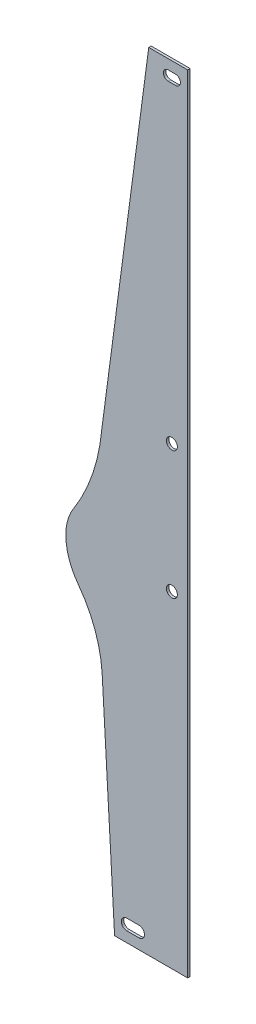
ISO-10303-21;
HEADER;
FILE_DESCRIPTION(('STEP AP214'),'2;1');
FILE_NAME('part.step','',(''),(''),'','','');
FILE_SCHEMA(('AUTOMOTIVE_DESIGN { 1 0 10303 214 1 1 1 1 }'));
ENDSEC;
DATA;
#1=APPLICATION_CONTEXT('core data for automotive mechanical design processes');
#2=APPLICATION_PROTOCOL_DEFINITION('international standard','automotive_design',2000,#1);
#3=PRODUCT_CONTEXT('',#1,'mechanical');
#4=PRODUCT('Part','Part','',(#3));
#5=PRODUCT_RELATED_PRODUCT_CATEGORY('part','',(#4));
#6=PRODUCT_DEFINITION_FORMATION('','',#4);
#7=PRODUCT_DEFINITION_CONTEXT('part definition',#1,'design');
#8=PRODUCT_DEFINITION('design','',#6,#7);
#9=PRODUCT_DEFINITION_SHAPE('','',#8);
#10=(LENGTH_UNIT() NAMED_UNIT(*) SI_UNIT(.MILLI.,.METRE.));
#11=(NAMED_UNIT(*) PLANE_ANGLE_UNIT() SI_UNIT($,.RADIAN.));
#12=(NAMED_UNIT(*) SI_UNIT($,.STERADIAN.) SOLID_ANGLE_UNIT());
#13=UNCERTAINTY_MEASURE_WITH_UNIT(LENGTH_MEASURE(1.E-05),#10,'distance_accuracy_value','');
#14=(GEOMETRIC_REPRESENTATION_CONTEXT(3) GLOBAL_UNCERTAINTY_ASSIGNED_CONTEXT((#13)) GLOBAL_UNIT_ASSIGNED_CONTEXT((#10,
#11,#12)) REPRESENTATION_CONTEXT('',''));
#15=CARTESIAN_POINT('',(0.,0.,0.));
#16=DIRECTION('',(0.,0.,1.));
#17=DIRECTION('',(1.,0.,0.));
#18=AXIS2_PLACEMENT_3D('',#15,#16,#17);
#19=CARTESIAN_POINT('',(-175.961770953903,-39.5408678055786,2.));
#20=DIRECTION('',(0.,0.,1.));
#21=DIRECTION('',(1.,0.,0.));
#22=AXIS2_PLACEMENT_3D('',#19,#20,#21);
#23=PLANE('',#22);
#24=DIRECTION('',(-1.,0.,0.));
#25=VECTOR('',#24,1.);
#26=CARTESIAN_POINT('',(4.03822904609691,-389.510375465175,2.));
#27=LINE('',#26,#25);
#28=CARTESIAN_POINT('',(4.03822904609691,-389.510375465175,2.));
#29=VERTEX_POINT('',#28);
#30=CARTESIAN_POINT('',(-5.96177095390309,-389.510375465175,2.));
#31=VERTEX_POINT('',#30);
#32=EDGE_CURVE('E199',#29,#31,#27,.T.);
#33=ORIENTED_EDGE('',*,*,#32,.F.);
#34=CARTESIAN_POINT('',(4.03822904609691,-394.010375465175,2.));
#35=DIRECTION('',(0.,0.,1.));
#36=DIRECTION('',(1.,0.,0.));
#37=AXIS2_PLACEMENT_3D('',#34,#35,#36);
#38=CIRCLE('',#37,4.5);
#39=CARTESIAN_POINT('',(4.03822904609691,-398.510375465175,2.));
#40=VERTEX_POINT('',#39);
#41=EDGE_CURVE('E197',#40,#29,#38,.T.);
#42=ORIENTED_EDGE('',*,*,#41,.F.);
#43=DIRECTION('',(1.,0.,0.));
#44=VECTOR('',#43,1.);
#45=CARTESIAN_POINT('',(4.03822904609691,-398.510375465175,2.));
#46=LINE('',#45,#44);
#47=CARTESIAN_POINT('',(-5.96177095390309,-398.510375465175,2.));
#48=VERTEX_POINT('',#47);
#49=EDGE_CURVE('E204',#48,#40,#46,.T.);
#50=ORIENTED_EDGE('',*,*,#49,.F.);
#51=CARTESIAN_POINT('',(-5.96177095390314,-394.010375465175,2.));
#52=DIRECTION('',(0.,0.,1.));
#53=DIRECTION('',(1.,0.,0.));
#54=AXIS2_PLACEMENT_3D('',#51,#52,#53);
#55=CIRCLE('',#54,4.5);
#56=EDGE_CURVE('E202',#31,#48,#55,.T.);
#57=ORIENTED_EDGE('',*,*,#56,.F.);
#58=EDGE_LOOP('',(#33,#42,#50,#57));
#59=FACE_BOUND('',#58,.T.);
#60=CARTESIAN_POINT('',(31.0382290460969,-34.0103754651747,2.));
#61=DIRECTION('',(0.,0.,1.));
#62=DIRECTION('',(1.,0.,0.));
#63=AXIS2_PLACEMENT_3D('',#60,#61,#62);
#64=CIRCLE('',#63,4.50000000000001);
#65=CARTESIAN_POINT('',(35.5382290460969,-34.0103754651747,2.));
#66=VERTEX_POINT('',#65);
#67=EDGE_CURVE('E225',#66,#66,#64,.T.);
#68=ORIENTED_EDGE('',*,*,#67,.F.);
#69=EDGE_LOOP('',(#68));
#70=FACE_BOUND('',#69,.T.);
#71=DIRECTION('',(-1.,0.,0.));
#72=VECTOR('',#71,1.);
#73=CARTESIAN_POINT('',(44.0382290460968,237.989624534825,2.));
#74=LINE('',#73,#72);
#75=CARTESIAN_POINT('',(44.0382290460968,237.989624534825,2.));
#76=VERTEX_POINT('',#75);
#77=CARTESIAN_POINT('',(12.0382290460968,237.989624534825,2.));
#78=VERTEX_POINT('',#77);
#79=EDGE_CURVE('E247',#76,#78,#74,.T.);
#80=ORIENTED_EDGE('',*,*,#79,.T.);
#81=DIRECTION('',(-0.131345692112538,-0.991336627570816,0.));
#82=VECTOR('',#81,1.);
#83=CARTESIAN_POINT('',(-27.9896974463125,-64.1226794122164,2.));
#84=LINE('',#83,#82);
#85=CARTESIAN_POINT('',(-27.9896974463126,-64.1226794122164,2.));
#86=VERTEX_POINT('',#85);
#87=EDGE_CURVE('E250',#78,#86,#84,.T.);
#88=ORIENTED_EDGE('',*,*,#87,.T.);
#89=CARTESIAN_POINT('',(-175.961770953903,-39.5408678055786,2.));
#90=DIRECTION('',(0.,0.,-1.));
#91=DIRECTION('',(1.,0.,0.));
#92=AXIS2_PLACEMENT_3D('',#89,#90,#91);
#93=CIRCLE('',#92,150.);
#94=CARTESIAN_POINT('',(-49.6459814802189,-120.437847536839,2.));
#95=VERTEX_POINT('',#94);
#96=EDGE_CURVE('E252',#86,#95,#93,.T.);
#97=ORIENTED_EDGE('',*,*,#96,.T.);
#98=CARTESIAN_POINT('',(-15.9617709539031,-142.010375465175,2.));
#99=DIRECTION('',(0.,0.,1.));
#100=DIRECTION('',(1.,0.,0.));
#101=AXIS2_PLACEMENT_3D('',#98,#99,#100);
#102=CIRCLE('',#101,40.);
#103=CARTESIAN_POINT('',(-55.9617709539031,-142.010375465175,2.));
#104=VERTEX_POINT('',#103);
#105=EDGE_CURVE('E254',#95,#104,#102,.T.);
#106=ORIENTED_EDGE('',*,*,#105,.T.);
#107=CARTESIAN_POINT('',(-5.96177095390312,-142.010375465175,2.));
#108=DIRECTION('',(0.,0.,1.));
#109=DIRECTION('',(1.,0.,0.));
#110=AXIS2_PLACEMENT_3D('',#107,#108,#109);
#111=CIRCLE('',#110,50.);
#112=CARTESIAN_POINT('',(-45.9617709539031,-172.010375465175,2.));
#113=VERTEX_POINT('',#112);
#114=EDGE_CURVE('E256',#104,#113,#111,.T.);
#115=ORIENTED_EDGE('',*,*,#114,.T.);
#116=CARTESIAN_POINT('',(-125.961770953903,-232.010375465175,2.));
#117=DIRECTION('',(0.,0.,-1.));
#118=DIRECTION('',(1.,0.,0.));
#119=AXIS2_PLACEMENT_3D('',#116,#117,#118);
#120=CIRCLE('',#119,100.);
#121=CARTESIAN_POINT('',(-26.1195429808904,-226.395260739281,2.));
#122=VERTEX_POINT('',#121);
#123=EDGE_CURVE('E258',#113,#122,#120,.T.);
#124=ORIENTED_EDGE('',*,*,#123,.T.);
#125=DIRECTION('',(0.0561511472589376,-0.998422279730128,0.));
#126=VECTOR('',#125,1.);
#127=CARTESIAN_POINT('',(-26.1195429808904,-226.395260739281,2.));
#128=LINE('',#127,#126);
#129=CARTESIAN_POINT('',(-15.9617709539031,-407.010375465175,2.));
#130=VERTEX_POINT('',#129);
#131=EDGE_CURVE('E260',#122,#130,#128,.T.);
#132=ORIENTED_EDGE('',*,*,#131,.T.);
#133=DIRECTION('',(1.,0.,0.));
#134=VECTOR('',#133,1.);
#135=CARTESIAN_POINT('',(44.0382290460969,-407.010375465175,2.));
#136=LINE('',#135,#134);
#137=CARTESIAN_POINT('',(44.0382290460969,-407.010375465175,2.));
#138=VERTEX_POINT('',#137);
#139=EDGE_CURVE('E262',#130,#138,#136,.T.);
#140=ORIENTED_EDGE('',*,*,#139,.T.);
#141=DIRECTION('',(0.,1.,0.));
#142=VECTOR('',#141,1.);
#143=CARTESIAN_POINT('',(44.0382290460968,237.989624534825,2.));
#144=LINE('',#143,#142);
#145=EDGE_CURVE('E264',#138,#76,#144,.T.);
#146=ORIENTED_EDGE('',*,*,#145,.T.);
#147=EDGE_LOOP('',(#80,#88,#97,#106,#115,#124,#132,#140,#146));
#148=FACE_BOUND('',#147,.T.);
#149=CARTESIAN_POINT('',(31.0382290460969,-139.010375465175,2.));
#150=DIRECTION('',(0.,0.,1.));
#151=DIRECTION('',(1.,0.,0.));
#152=AXIS2_PLACEMENT_3D('',#149,#150,#151);
#153=CIRCLE('',#152,4.50000000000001);
#154=CARTESIAN_POINT('',(35.5382290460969,-139.010375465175,2.));
#155=VERTEX_POINT('',#154);
#156=EDGE_CURVE('E219',#155,#155,#153,.T.);
#157=ORIENTED_EDGE('',*,*,#156,.F.);
#158=EDGE_LOOP('',(#157));
#159=FACE_BOUND('',#158,.T.);
#160=DIRECTION('',(-1.,0.,0.));
#161=VECTOR('',#160,1.);
#162=CARTESIAN_POINT('',(34.0382290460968,229.989624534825,2.));
#163=LINE('',#162,#161);
#164=CARTESIAN_POINT('',(34.0382290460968,229.989624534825,2.));
#165=VERTEX_POINT('',#164);
#166=CARTESIAN_POINT('',(28.0382290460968,229.989624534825,2.));
#167=VERTEX_POINT('',#166);
#168=EDGE_CURVE('E175',#165,#167,#163,.T.);
#169=ORIENTED_EDGE('',*,*,#168,.F.);
#170=CARTESIAN_POINT('',(34.0382290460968,225.989624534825,2.));
#171=DIRECTION('',(0.,0.,1.));
#172=DIRECTION('',(1.,0.,0.));
#173=AXIS2_PLACEMENT_3D('',#170,#171,#172);
#174=CIRCLE('',#173,4.);
#175=CARTESIAN_POINT('',(34.0382290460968,221.989624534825,2.));
#176=VERTEX_POINT('',#175);
#177=EDGE_CURVE('E166',#176,#165,#174,.T.);
#178=ORIENTED_EDGE('',*,*,#177,.F.);
#179=DIRECTION('',(1.,0.,0.));
#180=VECTOR('',#179,1.);
#181=CARTESIAN_POINT('',(34.0382290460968,221.989624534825,2.));
#182=LINE('',#181,#180);
#183=CARTESIAN_POINT('',(28.0382290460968,221.989624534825,2.));
#184=VERTEX_POINT('',#183);
#185=EDGE_CURVE('E179',#184,#176,#182,.T.);
#186=ORIENTED_EDGE('',*,*,#185,.F.);
#187=CARTESIAN_POINT('',(28.0382290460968,225.989624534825,2.));
#188=DIRECTION('',(0.,0.,1.));
#189=DIRECTION('',(1.,0.,0.));
#190=AXIS2_PLACEMENT_3D('',#187,#188,#189);
#191=CIRCLE('',#190,4.);
#192=EDGE_CURVE('E177',#167,#184,#191,.T.);
#193=ORIENTED_EDGE('',*,*,#192,.F.);
#194=EDGE_LOOP('',(#169,#178,#186,#193));
#195=FACE_BOUND('',#194,.T.);
#196=ADVANCED_FACE('F30',(#59,#70,#148,#159,#195),#23,.T.);
#197=CARTESIAN_POINT('',(-175.961770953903,-39.5408678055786,0.));
#198=DIRECTION('',(0.,0.,1.));
#199=DIRECTION('',(1.,0.,0.));
#200=AXIS2_PLACEMENT_3D('',#197,#198,#199);
#201=PLANE('',#200);
#202=DIRECTION('',(-1.,0.,0.));
#203=VECTOR('',#202,1.);
#204=CARTESIAN_POINT('',(4.03822904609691,-389.510375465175,0.));
#205=LINE('',#204,#203);
#206=CARTESIAN_POINT('',(4.03822904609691,-389.510375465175,0.));
#207=VERTEX_POINT('',#206);
#208=CARTESIAN_POINT('',(-5.96177095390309,-389.510375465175,0.));
#209=VERTEX_POINT('',#208);
#210=EDGE_CURVE('E188',#207,#209,#205,.T.);
#211=ORIENTED_EDGE('',*,*,#210,.T.);
#212=CARTESIAN_POINT('',(-5.96177095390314,-394.010375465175,0.));
#213=DIRECTION('',(0.,0.,1.));
#214=DIRECTION('',(1.,0.,0.));
#215=AXIS2_PLACEMENT_3D('',#212,#213,#214);
#216=CIRCLE('',#215,4.5);
#217=CARTESIAN_POINT('',(-5.96177095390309,-398.510375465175,0.));
#218=VERTEX_POINT('',#217);
#219=EDGE_CURVE('E191',#209,#218,#216,.T.);
#220=ORIENTED_EDGE('',*,*,#219,.T.);
#221=DIRECTION('',(1.,0.,0.));
#222=VECTOR('',#221,1.);
#223=CARTESIAN_POINT('',(4.03822904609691,-398.510375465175,0.));
#224=LINE('',#223,#222);
#225=CARTESIAN_POINT('',(4.03822904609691,-398.510375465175,0.));
#226=VERTEX_POINT('',#225);
#227=EDGE_CURVE('E194',#218,#226,#224,.T.);
#228=ORIENTED_EDGE('',*,*,#227,.T.);
#229=CARTESIAN_POINT('',(4.03822904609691,-394.010375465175,0.));
#230=DIRECTION('',(0.,0.,1.));
#231=DIRECTION('',(1.,0.,0.));
#232=AXIS2_PLACEMENT_3D('',#229,#230,#231);
#233=CIRCLE('',#232,4.5);
#234=EDGE_CURVE('E167',#226,#207,#233,.T.);
#235=ORIENTED_EDGE('',*,*,#234,.T.);
#236=EDGE_LOOP('',(#211,#220,#228,#235));
#237=FACE_BOUND('',#236,.T.);
#238=CARTESIAN_POINT('',(31.0382290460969,-34.0103754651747,0.));
#239=DIRECTION('',(0.,0.,1.));
#240=DIRECTION('',(1.,0.,0.));
#241=AXIS2_PLACEMENT_3D('',#238,#239,#240);
#242=CIRCLE('',#241,4.50000000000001);
#243=CARTESIAN_POINT('',(35.5382290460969,-34.0103754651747,0.));
#244=VERTEX_POINT('',#243);
#245=EDGE_CURVE('E222',#244,#244,#242,.T.);
#246=ORIENTED_EDGE('',*,*,#245,.T.);
#247=EDGE_LOOP('',(#246));
#248=FACE_BOUND('',#247,.T.);
#249=DIRECTION('',(-1.,0.,0.));
#250=VECTOR('',#249,1.);
#251=CARTESIAN_POINT('',(44.0382290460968,237.989624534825,0.));
#252=LINE('',#251,#250);
#253=CARTESIAN_POINT('',(44.0382290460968,237.989624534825,0.));
#254=VERTEX_POINT('',#253);
#255=CARTESIAN_POINT('',(12.0382290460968,237.989624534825,0.));
#256=VERTEX_POINT('',#255);
#257=EDGE_CURVE('E228',#254,#256,#252,.T.);
#258=ORIENTED_EDGE('',*,*,#257,.F.);
#259=DIRECTION('',(0.,1.,0.));
#260=VECTOR('',#259,1.);
#261=CARTESIAN_POINT('',(44.0382290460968,237.989624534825,0.));
#262=LINE('',#261,#260);
#263=CARTESIAN_POINT('',(44.0382290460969,-407.010375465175,0.));
#264=VERTEX_POINT('',#263);
#265=EDGE_CURVE('E245',#264,#254,#262,.T.);
#266=ORIENTED_EDGE('',*,*,#265,.F.);
#267=DIRECTION('',(1.,0.,0.));
#268=VECTOR('',#267,1.);
#269=CARTESIAN_POINT('',(44.0382290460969,-407.010375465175,0.));
#270=LINE('',#269,#268);
#271=CARTESIAN_POINT('',(-15.9617709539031,-407.010375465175,0.));
#272=VERTEX_POINT('',#271);
#273=EDGE_CURVE('E243',#272,#264,#270,.T.);
#274=ORIENTED_EDGE('',*,*,#273,.F.);
#275=DIRECTION('',(0.0561511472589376,-0.998422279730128,0.));
#276=VECTOR('',#275,1.);
#277=CARTESIAN_POINT('',(-26.1195429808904,-226.395260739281,0.));
#278=LINE('',#277,#276);
#279=CARTESIAN_POINT('',(-26.1195429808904,-226.395260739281,0.));
#280=VERTEX_POINT('',#279);
#281=EDGE_CURVE('E241',#280,#272,#278,.T.);
#282=ORIENTED_EDGE('',*,*,#281,.F.);
#283=CARTESIAN_POINT('',(-125.961770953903,-232.010375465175,0.));
#284=DIRECTION('',(0.,0.,-1.));
#285=DIRECTION('',(1.,0.,0.));
#286=AXIS2_PLACEMENT_3D('',#283,#284,#285);
#287=CIRCLE('',#286,100.);
#288=CARTESIAN_POINT('',(-45.9617709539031,-172.010375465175,0.));
#289=VERTEX_POINT('',#288);
#290=EDGE_CURVE('E239',#289,#280,#287,.T.);
#291=ORIENTED_EDGE('',*,*,#290,.F.);
#292=CARTESIAN_POINT('',(-5.96177095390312,-142.010375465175,0.));
#293=DIRECTION('',(0.,0.,1.));
#294=DIRECTION('',(1.,0.,0.));
#295=AXIS2_PLACEMENT_3D('',#292,#293,#294);
#296=CIRCLE('',#295,50.);
#297=CARTESIAN_POINT('',(-55.9617709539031,-142.010375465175,0.));
#298=VERTEX_POINT('',#297);
#299=EDGE_CURVE('E237',#298,#289,#296,.T.);
#300=ORIENTED_EDGE('',*,*,#299,.F.);
#301=CARTESIAN_POINT('',(-15.9617709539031,-142.010375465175,0.));
#302=DIRECTION('',(0.,0.,1.));
#303=DIRECTION('',(1.,0.,0.));
#304=AXIS2_PLACEMENT_3D('',#301,#302,#303);
#305=CIRCLE('',#304,40.);
#306=CARTESIAN_POINT('',(-49.6459814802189,-120.437847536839,0.));
#307=VERTEX_POINT('',#306);
#308=EDGE_CURVE('E235',#307,#298,#305,.T.);
#309=ORIENTED_EDGE('',*,*,#308,.F.);
#310=CARTESIAN_POINT('',(-175.961770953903,-39.5408678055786,0.));
#311=DIRECTION('',(0.,0.,-1.));
#312=DIRECTION('',(1.,0.,0.));
#313=AXIS2_PLACEMENT_3D('',#310,#311,#312);
#314=CIRCLE('',#313,150.);
#315=CARTESIAN_POINT('',(-27.9896974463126,-64.1226794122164,0.));
#316=VERTEX_POINT('',#315);
#317=EDGE_CURVE('E233',#316,#307,#314,.T.);
#318=ORIENTED_EDGE('',*,*,#317,.F.);
#319=DIRECTION('',(-0.131345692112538,-0.991336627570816,0.));
#320=VECTOR('',#319,1.);
#321=CARTESIAN_POINT('',(-27.9896974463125,-64.1226794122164,0.));
#322=LINE('',#321,#320);
#323=EDGE_CURVE('E231',#256,#316,#322,.T.);
#324=ORIENTED_EDGE('',*,*,#323,.F.);
#325=EDGE_LOOP('',(#258,#266,#274,#282,#291,#300,#309,#318,#324));
#326=FACE_BOUND('',#325,.T.);
#327=CARTESIAN_POINT('',(31.0382290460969,-139.010375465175,0.));
#328=DIRECTION('',(0.,0.,1.));
#329=DIRECTION('',(1.,0.,0.));
#330=AXIS2_PLACEMENT_3D('',#327,#328,#329);
#331=CIRCLE('',#330,4.50000000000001);
#332=CARTESIAN_POINT('',(35.5382290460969,-139.010375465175,0.));
#333=VERTEX_POINT('',#332);
#334=EDGE_CURVE('E216',#333,#333,#331,.T.);
#335=ORIENTED_EDGE('',*,*,#334,.T.);
#336=EDGE_LOOP('',(#335));
#337=FACE_BOUND('',#336,.T.);
#338=DIRECTION('',(-1.,0.,0.));
#339=VECTOR('',#338,1.);
#340=CARTESIAN_POINT('',(34.0382290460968,229.989624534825,0.));
#341=LINE('',#340,#339);
#342=CARTESIAN_POINT('',(34.0382290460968,229.989624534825,0.));
#343=VERTEX_POINT('',#342);
#344=CARTESIAN_POINT('',(28.0382290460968,229.989624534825,0.));
#345=VERTEX_POINT('',#344);
#346=EDGE_CURVE('E150',#343,#345,#341,.T.);
#347=ORIENTED_EDGE('',*,*,#346,.T.);
#348=CARTESIAN_POINT('',(28.0382290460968,225.989624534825,0.));
#349=DIRECTION('',(0.,0.,1.));
#350=DIRECTION('',(1.,0.,0.));
#351=AXIS2_PLACEMENT_3D('',#348,#349,#350);
#352=CIRCLE('',#351,4.);
#353=CARTESIAN_POINT('',(28.0382290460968,221.989624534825,0.));
#354=VERTEX_POINT('',#353);
#355=EDGE_CURVE('E158',#345,#354,#352,.T.);
#356=ORIENTED_EDGE('',*,*,#355,.T.);
#357=DIRECTION('',(1.,0.,0.));
#358=VECTOR('',#357,1.);
#359=CARTESIAN_POINT('',(34.0382290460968,221.989624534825,0.));
#360=LINE('',#359,#358);
#361=CARTESIAN_POINT('',(34.0382290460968,221.989624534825,0.));
#362=VERTEX_POINT('',#361);
#363=EDGE_CURVE('E53',#354,#362,#360,.T.);
#364=ORIENTED_EDGE('',*,*,#363,.T.);
#365=CARTESIAN_POINT('',(34.0382290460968,225.989624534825,0.));
#366=DIRECTION('',(0.,0.,1.));
#367=DIRECTION('',(1.,0.,0.));
#368=AXIS2_PLACEMENT_3D('',#365,#366,#367);
#369=CIRCLE('',#368,4.);
#370=EDGE_CURVE('E159',#362,#343,#369,.T.);
#371=ORIENTED_EDGE('',*,*,#370,.T.);
#372=EDGE_LOOP('',(#347,#356,#364,#371));
#373=FACE_BOUND('',#372,.T.);
#374=ADVANCED_FACE('F169',(#237,#248,#326,#337,#373),#201,.F.);
#375=CARTESIAN_POINT('',(44.0382290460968,237.989624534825,2.));
#376=DIRECTION('',(0.,-1.,0.));
#377=DIRECTION('',(0.,0.,-1.));
#378=AXIS2_PLACEMENT_3D('',#375,#376,#377);
#379=PLANE('',#378);
#380=ORIENTED_EDGE('',*,*,#257,.T.);
#381=DIRECTION('',(0.,0.,-1.));
#382=VECTOR('',#381,1.);
#383=CARTESIAN_POINT('',(12.0382290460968,237.989624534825,2.));
#384=LINE('',#383,#382);
#385=EDGE_CURVE('E11',#78,#256,#384,.T.);
#386=ORIENTED_EDGE('',*,*,#385,.F.);
#387=ORIENTED_EDGE('',*,*,#79,.F.);
#388=DIRECTION('',(0.,0.,-1.));
#389=VECTOR('',#388,1.);
#390=CARTESIAN_POINT('',(44.0382290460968,237.989624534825,2.));
#391=LINE('',#390,#389);
#392=EDGE_CURVE('E266',#76,#254,#391,.T.);
#393=ORIENTED_EDGE('',*,*,#392,.T.);
#394=EDGE_LOOP('',(#380,#386,#387,#393));
#395=FACE_BOUND('',#394,.T.);
#396=ADVANCED_FACE('F32',(#395),#379,.F.);
#397=CARTESIAN_POINT('',(-27.9896974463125,-64.1226794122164,2.));
#398=DIRECTION('',(0.991336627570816,-0.131345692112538,0.));
#399=DIRECTION('',(0.131345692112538,0.991336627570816,0.));
#400=AXIS2_PLACEMENT_3D('',#397,#398,#399);
#401=PLANE('',#400);
#402=ORIENTED_EDGE('',*,*,#323,.T.);
#403=DIRECTION('',(0.,0.,-1.));
#404=VECTOR('',#403,1.);
#405=CARTESIAN_POINT('',(-27.9896974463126,-64.1226794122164,2.));
#406=LINE('',#405,#404);
#407=EDGE_CURVE('E38',#86,#316,#406,.T.);
#408=ORIENTED_EDGE('',*,*,#407,.F.);
#409=ORIENTED_EDGE('',*,*,#87,.F.);
#410=ORIENTED_EDGE('',*,*,#385,.T.);
#411=EDGE_LOOP('',(#402,#408,#409,#410));
#412=FACE_BOUND('',#411,.T.);
#413=ADVANCED_FACE('F314',(#412),#401,.F.);
#414=CARTESIAN_POINT('',(-175.961770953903,-39.5408678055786,2.));
#415=DIRECTION('',(0.,0.,-1.));
#416=DIRECTION('',(-1.,0.,0.));
#417=AXIS2_PLACEMENT_3D('',#414,#415,#416);
#418=CYLINDRICAL_SURFACE('',#417,150.);
#419=ORIENTED_EDGE('',*,*,#317,.T.);
#420=DIRECTION('',(0.,0.,-1.));
#421=VECTOR('',#420,1.);
#422=CARTESIAN_POINT('',(-49.6459814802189,-120.437847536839,2.));
#423=LINE('',#422,#421);
#424=EDGE_CURVE('E284',#95,#307,#423,.T.);
#425=ORIENTED_EDGE('',*,*,#424,.F.);
#426=ORIENTED_EDGE('',*,*,#96,.F.);
#427=ORIENTED_EDGE('',*,*,#407,.T.);
#428=EDGE_LOOP('',(#419,#425,#426,#427));
#429=FACE_BOUND('',#428,.T.);
#430=ADVANCED_FACE('F291',(#429),#418,.F.);
#431=CARTESIAN_POINT('',(-15.9617709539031,-142.010375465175,2.));
#432=DIRECTION('',(0.,0.,-1.));
#433=DIRECTION('',(-1.,0.,0.));
#434=AXIS2_PLACEMENT_3D('',#431,#432,#433);
#435=CYLINDRICAL_SURFACE('',#434,40.);
#436=ORIENTED_EDGE('',*,*,#308,.T.);
#437=DIRECTION('',(0.,0.,-1.));
#438=VECTOR('',#437,1.);
#439=CARTESIAN_POINT('',(-55.9617709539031,-142.010375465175,2.));
#440=LINE('',#439,#438);
#441=EDGE_CURVE('E281',#104,#298,#440,.T.);
#442=ORIENTED_EDGE('',*,*,#441,.F.);
#443=ORIENTED_EDGE('',*,*,#105,.F.);
#444=ORIENTED_EDGE('',*,*,#424,.T.);
#445=EDGE_LOOP('',(#436,#442,#443,#444));
#446=FACE_BOUND('',#445,.T.);
#447=ADVANCED_FACE('F302',(#446),#435,.T.);
#448=CARTESIAN_POINT('',(-5.96177095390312,-142.010375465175,2.));
#449=DIRECTION('',(0.,0.,-1.));
#450=DIRECTION('',(-1.,0.,0.));
#451=AXIS2_PLACEMENT_3D('',#448,#449,#450);
#452=CYLINDRICAL_SURFACE('',#451,50.);
#453=ORIENTED_EDGE('',*,*,#299,.T.);
#454=DIRECTION('',(0.,0.,-1.));
#455=VECTOR('',#454,1.);
#456=CARTESIAN_POINT('',(-45.9617709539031,-172.010375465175,2.));
#457=LINE('',#456,#455);
#458=EDGE_CURVE('E278',#113,#289,#457,.T.);
#459=ORIENTED_EDGE('',*,*,#458,.F.);
#460=ORIENTED_EDGE('',*,*,#114,.F.);
#461=ORIENTED_EDGE('',*,*,#441,.T.);
#462=EDGE_LOOP('',(#453,#459,#460,#461));
#463=FACE_BOUND('',#462,.T.);
#464=ADVANCED_FACE('F306',(#463),#452,.T.);
#465=CARTESIAN_POINT('',(-125.961770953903,-232.010375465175,2.));
#466=DIRECTION('',(0.,0.,-1.));
#467=DIRECTION('',(-1.,0.,0.));
#468=AXIS2_PLACEMENT_3D('',#465,#466,#467);
#469=CYLINDRICAL_SURFACE('',#468,100.);
#470=ORIENTED_EDGE('',*,*,#290,.T.);
#471=DIRECTION('',(0.,0.,-1.));
#472=VECTOR('',#471,1.);
#473=CARTESIAN_POINT('',(-26.1195429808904,-226.395260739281,2.));
#474=LINE('',#473,#472);
#475=EDGE_CURVE('E275',#122,#280,#474,.T.);
#476=ORIENTED_EDGE('',*,*,#475,.F.);
#477=ORIENTED_EDGE('',*,*,#123,.F.);
#478=ORIENTED_EDGE('',*,*,#458,.T.);
#479=EDGE_LOOP('',(#470,#476,#477,#478));
#480=FACE_BOUND('',#479,.T.);
#481=ADVANCED_FACE('F332',(#480),#469,.F.);
#482=CARTESIAN_POINT('',(-26.1195429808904,-226.395260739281,2.));
#483=DIRECTION('',(0.998422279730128,0.0561511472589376,0.));
#484=DIRECTION('',(-0.0561511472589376,0.998422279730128,0.));
#485=AXIS2_PLACEMENT_3D('',#482,#483,#484);
#486=PLANE('',#485);
#487=ORIENTED_EDGE('',*,*,#281,.T.);
#488=DIRECTION('',(0.,0.,-1.));
#489=VECTOR('',#488,1.);
#490=CARTESIAN_POINT('',(-15.9617709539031,-407.010375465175,2.));
#491=LINE('',#490,#489);
#492=EDGE_CURVE('E272',#130,#272,#491,.T.);
#493=ORIENTED_EDGE('',*,*,#492,.F.);
#494=ORIENTED_EDGE('',*,*,#131,.F.);
#495=ORIENTED_EDGE('',*,*,#475,.T.);
#496=EDGE_LOOP('',(#487,#493,#494,#495));
#497=FACE_BOUND('',#496,.T.);
#498=ADVANCED_FACE('F330',(#497),#486,.F.);
#499=CARTESIAN_POINT('',(44.0382290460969,-407.010375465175,2.));
#500=DIRECTION('',(0.,1.,0.));
#501=DIRECTION('',(0.,0.,1.));
#502=AXIS2_PLACEMENT_3D('',#499,#500,#501);
#503=PLANE('',#502);
#504=ORIENTED_EDGE('',*,*,#273,.T.);
#505=DIRECTION('',(0.,0.,-1.));
#506=VECTOR('',#505,1.);
#507=CARTESIAN_POINT('',(44.0382290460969,-407.010375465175,2.));
#508=LINE('',#507,#506);
#509=EDGE_CURVE('E269',#138,#264,#508,.T.);
#510=ORIENTED_EDGE('',*,*,#509,.F.);
#511=ORIENTED_EDGE('',*,*,#139,.F.);
#512=ORIENTED_EDGE('',*,*,#492,.T.);
#513=EDGE_LOOP('',(#504,#510,#511,#512));
#514=FACE_BOUND('',#513,.T.);
#515=ADVANCED_FACE('F326',(#514),#503,.F.);
#516=CARTESIAN_POINT('',(44.0382290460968,237.989624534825,2.));
#517=DIRECTION('',(-1.,0.,0.));
#518=DIRECTION('',(0.,-1.,0.));
#519=AXIS2_PLACEMENT_3D('',#516,#517,#518);
#520=PLANE('',#519);
#521=ORIENTED_EDGE('',*,*,#265,.T.);
#522=ORIENTED_EDGE('',*,*,#392,.F.);
#523=ORIENTED_EDGE('',*,*,#145,.F.);
#524=ORIENTED_EDGE('',*,*,#509,.T.);
#525=EDGE_LOOP('',(#521,#522,#523,#524));
#526=FACE_BOUND('',#525,.T.);
#527=ADVANCED_FACE('F321',(#526),#520,.F.);
#528=CARTESIAN_POINT('',(31.0382290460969,-34.0103754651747,2.));
#529=DIRECTION('',(0.,0.,-1.));
#530=DIRECTION('',(-1.,0.,0.));
#531=AXIS2_PLACEMENT_3D('',#528,#529,#530);
#532=CYLINDRICAL_SURFACE('',#531,4.50000000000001);
#533=ORIENTED_EDGE('',*,*,#67,.T.);
#534=EDGE_LOOP('',(#533));
#535=FACE_BOUND('',#534,.T.);
#536=ORIENTED_EDGE('',*,*,#245,.F.);
#537=EDGE_LOOP('',(#536));
#538=FACE_BOUND('',#537,.T.);
#539=ADVANCED_FACE('F355',(#535,#538),#532,.F.);
#540=CARTESIAN_POINT('',(31.0382290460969,-139.010375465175,2.));
#541=DIRECTION('',(0.,0.,-1.));
#542=DIRECTION('',(-1.,0.,0.));
#543=AXIS2_PLACEMENT_3D('',#540,#541,#542);
#544=CYLINDRICAL_SURFACE('',#543,4.50000000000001);
#545=ORIENTED_EDGE('',*,*,#156,.T.);
#546=EDGE_LOOP('',(#545));
#547=FACE_BOUND('',#546,.T.);
#548=ORIENTED_EDGE('',*,*,#334,.F.);
#549=EDGE_LOOP('',(#548));
#550=FACE_BOUND('',#549,.T.);
#551=ADVANCED_FACE('F371',(#547,#550),#544,.F.);
#552=CARTESIAN_POINT('',(4.03822904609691,-394.010375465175,2.));
#553=DIRECTION('',(0.,0.,-1.));
#554=DIRECTION('',(-1.,0.,0.));
#555=AXIS2_PLACEMENT_3D('',#552,#553,#554);
#556=CYLINDRICAL_SURFACE('',#555,4.5);
#557=ORIENTED_EDGE('',*,*,#234,.F.);
#558=DIRECTION('',(0.,0.,-1.));
#559=VECTOR('',#558,1.);
#560=CARTESIAN_POINT('',(4.03822904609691,-398.510375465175,2.));
#561=LINE('',#560,#559);
#562=EDGE_CURVE('E206',#40,#226,#561,.T.);
#563=ORIENTED_EDGE('',*,*,#562,.F.);
#564=ORIENTED_EDGE('',*,*,#41,.T.);
#565=DIRECTION('',(0.,0.,-1.));
#566=VECTOR('',#565,1.);
#567=CARTESIAN_POINT('',(4.03822904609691,-389.510375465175,2.));
#568=LINE('',#567,#566);
#569=EDGE_CURVE('E213',#29,#207,#568,.T.);
#570=ORIENTED_EDGE('',*,*,#569,.T.);
#571=EDGE_LOOP('',(#557,#563,#564,#570));
#572=FACE_BOUND('',#571,.T.);
#573=ADVANCED_FACE('F378',(#572),#556,.F.);
#574=CARTESIAN_POINT('',(4.03822904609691,-389.510375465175,2.));
#575=DIRECTION('',(0.,-1.,0.));
#576=DIRECTION('',(0.,0.,-1.));
#577=AXIS2_PLACEMENT_3D('',#574,#575,#576);
#578=PLANE('',#577);
#579=ORIENTED_EDGE('',*,*,#210,.F.);
#580=ORIENTED_EDGE('',*,*,#569,.F.);
#581=ORIENTED_EDGE('',*,*,#32,.T.);
#582=DIRECTION('',(0.,0.,-1.));
#583=VECTOR('',#582,1.);
#584=CARTESIAN_POINT('',(-5.96177095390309,-389.510375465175,2.));
#585=LINE('',#584,#583);
#586=EDGE_CURVE('E211',#31,#209,#585,.T.);
#587=ORIENTED_EDGE('',*,*,#586,.T.);
#588=EDGE_LOOP('',(#579,#580,#581,#587));
#589=FACE_BOUND('',#588,.T.);
#590=ADVANCED_FACE('F386',(#589),#578,.T.);
#591=CARTESIAN_POINT('',(-5.96177095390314,-394.010375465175,2.));
#592=DIRECTION('',(0.,0.,-1.));
#593=DIRECTION('',(-1.,0.,0.));
#594=AXIS2_PLACEMENT_3D('',#591,#592,#593);
#595=CYLINDRICAL_SURFACE('',#594,4.5);
#596=ORIENTED_EDGE('',*,*,#219,.F.);
#597=ORIENTED_EDGE('',*,*,#586,.F.);
#598=ORIENTED_EDGE('',*,*,#56,.T.);
#599=DIRECTION('',(0.,0.,-1.));
#600=VECTOR('',#599,1.);
#601=CARTESIAN_POINT('',(-5.96177095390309,-398.510375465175,2.));
#602=LINE('',#601,#600);
#603=EDGE_CURVE('E208',#48,#218,#602,.T.);
#604=ORIENTED_EDGE('',*,*,#603,.T.);
#605=EDGE_LOOP('',(#596,#597,#598,#604));
#606=FACE_BOUND('',#605,.T.);
#607=ADVANCED_FACE('F394',(#606),#595,.F.);
#608=CARTESIAN_POINT('',(4.03822904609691,-398.510375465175,2.));
#609=DIRECTION('',(0.,1.,0.));
#610=DIRECTION('',(0.,0.,1.));
#611=AXIS2_PLACEMENT_3D('',#608,#609,#610);
#612=PLANE('',#611);
#613=ORIENTED_EDGE('',*,*,#227,.F.);
#614=ORIENTED_EDGE('',*,*,#603,.F.);
#615=ORIENTED_EDGE('',*,*,#49,.T.);
#616=ORIENTED_EDGE('',*,*,#562,.T.);
#617=EDGE_LOOP('',(#613,#614,#615,#616));
#618=FACE_BOUND('',#617,.T.);
#619=ADVANCED_FACE('F402',(#618),#612,.T.);
#620=CARTESIAN_POINT('',(34.0382290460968,225.989624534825,2.));
#621=DIRECTION('',(0.,0.,-1.));
#622=DIRECTION('',(-1.,0.,0.));
#623=AXIS2_PLACEMENT_3D('',#620,#621,#622);
#624=CYLINDRICAL_SURFACE('',#623,4.);
#625=ORIENTED_EDGE('',*,*,#370,.F.);
#626=DIRECTION('',(0.,0.,-1.));
#627=VECTOR('',#626,1.);
#628=CARTESIAN_POINT('',(34.0382290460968,221.989624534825,2.));
#629=LINE('',#628,#627);
#630=EDGE_CURVE('E181',#176,#362,#629,.T.);
#631=ORIENTED_EDGE('',*,*,#630,.F.);
#632=ORIENTED_EDGE('',*,*,#177,.T.);
#633=DIRECTION('',(0.,0.,-1.));
#634=VECTOR('',#633,1.);
#635=CARTESIAN_POINT('',(34.0382290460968,229.989624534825,2.));
#636=LINE('',#635,#634);
#637=EDGE_CURVE('E153',#165,#343,#636,.T.);
#638=ORIENTED_EDGE('',*,*,#637,.T.);
#639=EDGE_LOOP('',(#625,#631,#632,#638));
#640=FACE_BOUND('',#639,.T.);
#641=ADVANCED_FACE('F163',(#640),#624,.F.);
#642=CARTESIAN_POINT('',(34.0382290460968,229.989624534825,2.));
#643=DIRECTION('',(0.,-1.,0.));
#644=DIRECTION('',(0.,0.,-1.));
#645=AXIS2_PLACEMENT_3D('',#642,#643,#644);
#646=PLANE('',#645);
#647=ORIENTED_EDGE('',*,*,#346,.F.);
#648=ORIENTED_EDGE('',*,*,#637,.F.);
#649=ORIENTED_EDGE('',*,*,#168,.T.);
#650=DIRECTION('',(0.,0.,-1.));
#651=VECTOR('',#650,1.);
#652=CARTESIAN_POINT('',(28.0382290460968,229.989624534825,2.));
#653=LINE('',#652,#651);
#654=EDGE_CURVE('E45',#167,#345,#653,.T.);
#655=ORIENTED_EDGE('',*,*,#654,.T.);
#656=EDGE_LOOP('',(#647,#648,#649,#655));
#657=FACE_BOUND('',#656,.T.);
#658=ADVANCED_FACE('F152',(#657),#646,.T.);
#659=CARTESIAN_POINT('',(28.0382290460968,225.989624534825,2.));
#660=DIRECTION('',(0.,0.,-1.));
#661=DIRECTION('',(-1.,0.,0.));
#662=AXIS2_PLACEMENT_3D('',#659,#660,#661);
#663=CYLINDRICAL_SURFACE('',#662,4.);
#664=ORIENTED_EDGE('',*,*,#355,.F.);
#665=ORIENTED_EDGE('',*,*,#654,.F.);
#666=ORIENTED_EDGE('',*,*,#192,.T.);
#667=DIRECTION('',(0.,0.,-1.));
#668=VECTOR('',#667,1.);
#669=CARTESIAN_POINT('',(28.0382290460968,221.989624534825,2.));
#670=LINE('',#669,#668);
#671=EDGE_CURVE('E183',#184,#354,#670,.T.);
#672=ORIENTED_EDGE('',*,*,#671,.T.);
#673=EDGE_LOOP('',(#664,#665,#666,#672));
#674=FACE_BOUND('',#673,.T.);
#675=ADVANCED_FACE('F423',(#674),#663,.F.);
#676=CARTESIAN_POINT('',(34.0382290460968,221.989624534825,2.));
#677=DIRECTION('',(0.,1.,0.));
#678=DIRECTION('',(0.,0.,1.));
#679=AXIS2_PLACEMENT_3D('',#676,#677,#678);
#680=PLANE('',#679);
#681=ORIENTED_EDGE('',*,*,#363,.F.);
#682=ORIENTED_EDGE('',*,*,#671,.F.);
#683=ORIENTED_EDGE('',*,*,#185,.T.);
#684=ORIENTED_EDGE('',*,*,#630,.T.);
#685=EDGE_LOOP('',(#681,#682,#683,#684));
#686=FACE_BOUND('',#685,.T.);
#687=ADVANCED_FACE('F430',(#686),#680,.T.);
#688=CLOSED_SHELL('',(#196,#374,#396,#413,#430,#447,#464,#481,#498,#515,#527,#539,#551,#573,
#590,#607,#619,#641,#658,#675,#687));
#689=MANIFOLD_SOLID_BREP('B2',#688);
#690=ADVANCED_BREP_SHAPE_REPRESENTATION('',(#18,#689),#14);
#691=SHAPE_DEFINITION_REPRESENTATION(#9,#690);
ENDSEC;
END-ISO-10303-21;
